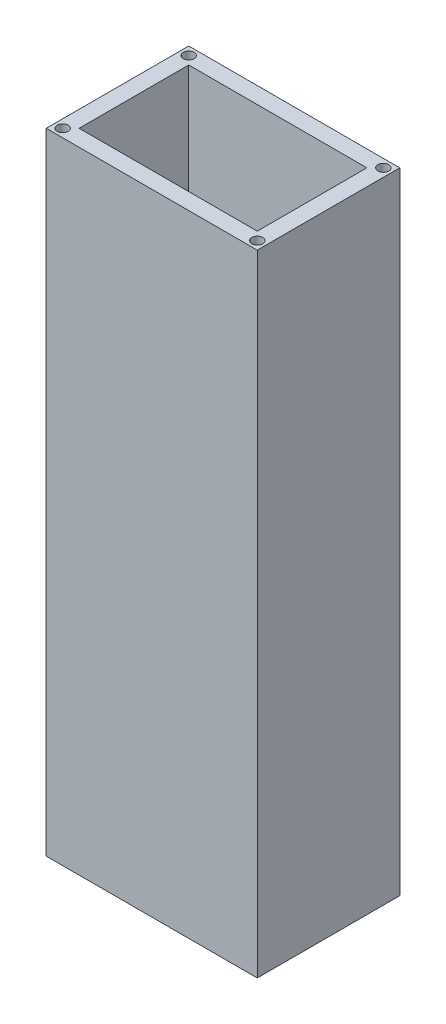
ISO-10303-21;
HEADER;
FILE_DESCRIPTION(('STEP AP214'),'2;1');
FILE_NAME('part.step','',(''),(''),'','','');
FILE_SCHEMA(('AUTOMOTIVE_DESIGN { 1 0 10303 214 1 1 1 1 }'));
ENDSEC;
DATA;
#1=APPLICATION_CONTEXT('core data for automotive mechanical design processes');
#2=APPLICATION_PROTOCOL_DEFINITION('international standard','automotive_design',2000,#1);
#3=PRODUCT_CONTEXT('',#1,'mechanical');
#4=PRODUCT('Part','Part','',(#3));
#5=PRODUCT_RELATED_PRODUCT_CATEGORY('part','',(#4));
#6=PRODUCT_DEFINITION_FORMATION('','',#4);
#7=PRODUCT_DEFINITION_CONTEXT('part definition',#1,'design');
#8=PRODUCT_DEFINITION('design','',#6,#7);
#9=PRODUCT_DEFINITION_SHAPE('','',#8);
#10=(LENGTH_UNIT() NAMED_UNIT(*) SI_UNIT(.MILLI.,.METRE.));
#11=(NAMED_UNIT(*) PLANE_ANGLE_UNIT() SI_UNIT($,.RADIAN.));
#12=(NAMED_UNIT(*) SI_UNIT($,.STERADIAN.) SOLID_ANGLE_UNIT());
#13=UNCERTAINTY_MEASURE_WITH_UNIT(LENGTH_MEASURE(1.E-05),#10,'distance_accuracy_value','');
#14=(GEOMETRIC_REPRESENTATION_CONTEXT(3) GLOBAL_UNCERTAINTY_ASSIGNED_CONTEXT((#13)) GLOBAL_UNIT_ASSIGNED_CONTEXT((#10,
#11,#12)) REPRESENTATION_CONTEXT('',''));
#15=CARTESIAN_POINT('',(0.,0.,0.));
#16=DIRECTION('',(0.,0.,1.));
#17=DIRECTION('',(1.,0.,0.));
#18=AXIS2_PLACEMENT_3D('',#15,#16,#17);
#19=CARTESIAN_POINT('',(0.,230.,0.));
#20=DIRECTION('',(0.,-1.,0.));
#21=DIRECTION('',(0.,0.,-1.));
#22=AXIS2_PLACEMENT_3D('',#19,#20,#21);
#23=PLANE('',#22);
#24=DIRECTION('',(0.,0.,1.));
#25=VECTOR('',#24,1.);
#26=CARTESIAN_POINT('',(-38.5,230.,26.));
#27=LINE('',#26,#25);
#28=CARTESIAN_POINT('',(-38.5,230.,-26.));
#29=VERTEX_POINT('',#28);
#30=CARTESIAN_POINT('',(-38.5,230.,26.));
#31=VERTEX_POINT('',#30);
#32=EDGE_CURVE('E246',#29,#31,#27,.T.);
#33=ORIENTED_EDGE('',*,*,#32,.T.);
#34=DIRECTION('',(1.,0.,0.));
#35=VECTOR('',#34,1.);
#36=CARTESIAN_POINT('',(-38.5,230.,26.));
#37=LINE('',#36,#35);
#38=CARTESIAN_POINT('',(38.5,230.,26.));
#39=VERTEX_POINT('',#38);
#40=EDGE_CURVE('E250',#31,#39,#37,.T.);
#41=ORIENTED_EDGE('',*,*,#40,.T.);
#42=DIRECTION('',(0.,0.,-1.));
#43=VECTOR('',#42,1.);
#44=CARTESIAN_POINT('',(38.5,230.,26.));
#45=LINE('',#44,#43);
#46=CARTESIAN_POINT('',(38.5,230.,-26.));
#47=VERTEX_POINT('',#46);
#48=EDGE_CURVE('E254',#39,#47,#45,.T.);
#49=ORIENTED_EDGE('',*,*,#48,.T.);
#50=DIRECTION('',(-1.,0.,0.));
#51=VECTOR('',#50,1.);
#52=CARTESIAN_POINT('',(-38.5,230.,-26.));
#53=LINE('',#52,#51);
#54=EDGE_CURVE('E257',#47,#29,#53,.T.);
#55=ORIENTED_EDGE('',*,*,#54,.T.);
#56=EDGE_LOOP('',(#33,#41,#49,#55));
#57=FACE_BOUND('',#56,.T.);
#58=DIRECTION('',(0.,0.,-1.));
#59=VECTOR('',#58,1.);
#60=CARTESIAN_POINT('',(32.5,230.,20.));
#61=LINE('',#60,#59);
#62=CARTESIAN_POINT('',(32.5,230.,20.));
#63=VERTEX_POINT('',#62);
#64=CARTESIAN_POINT('',(32.5,230.,-20.));
#65=VERTEX_POINT('',#64);
#66=EDGE_CURVE('E203',#63,#65,#61,.T.);
#67=ORIENTED_EDGE('',*,*,#66,.F.);
#68=DIRECTION('',(1.,0.,0.));
#69=VECTOR('',#68,1.);
#70=CARTESIAN_POINT('',(-32.5,230.,20.));
#71=LINE('',#70,#69);
#72=CARTESIAN_POINT('',(-32.5,230.,20.));
#73=VERTEX_POINT('',#72);
#74=EDGE_CURVE('E214',#73,#63,#71,.T.);
#75=ORIENTED_EDGE('',*,*,#74,.F.);
#76=DIRECTION('',(0.,0.,1.));
#77=VECTOR('',#76,1.);
#78=CARTESIAN_POINT('',(-32.5,230.,20.));
#79=LINE('',#78,#77);
#80=CARTESIAN_POINT('',(-32.5,230.,-20.));
#81=VERTEX_POINT('',#80);
#82=EDGE_CURVE('E210',#81,#73,#79,.T.);
#83=ORIENTED_EDGE('',*,*,#82,.F.);
#84=DIRECTION('',(-1.,0.,0.));
#85=VECTOR('',#84,1.);
#86=CARTESIAN_POINT('',(-32.5,230.,-20.));
#87=LINE('',#86,#85);
#88=EDGE_CURVE('E206',#65,#81,#87,.T.);
#89=ORIENTED_EDGE('',*,*,#88,.F.);
#90=EDGE_LOOP('',(#67,#75,#83,#89));
#91=FACE_BOUND('',#90,.T.);
#92=CARTESIAN_POINT('',(35.5,230.,-23.));
#93=DIRECTION('',(0.,1.,0.));
#94=DIRECTION('',(0.,0.,1.));
#95=AXIS2_PLACEMENT_3D('',#92,#93,#94);
#96=CIRCLE('',#95,2.);
#97=CARTESIAN_POINT('',(35.5,230.,-21.));
#98=VERTEX_POINT('',#97);
#99=EDGE_CURVE('E195',#98,#98,#96,.T.);
#100=ORIENTED_EDGE('',*,*,#99,.F.);
#101=EDGE_LOOP('',(#100));
#102=FACE_BOUND('',#101,.T.);
#103=CARTESIAN_POINT('',(35.5,230.,23.));
#104=DIRECTION('',(0.,1.,0.));
#105=DIRECTION('',(0.,0.,-1.));
#106=AXIS2_PLACEMENT_3D('',#103,#104,#105);
#107=CIRCLE('',#106,2.);
#108=CARTESIAN_POINT('',(35.5,230.,21.));
#109=VERTEX_POINT('',#108);
#110=EDGE_CURVE('E187',#109,#109,#107,.T.);
#111=ORIENTED_EDGE('',*,*,#110,.F.);
#112=EDGE_LOOP('',(#111));
#113=FACE_BOUND('',#112,.T.);
#114=CARTESIAN_POINT('',(-35.5,230.,23.));
#115=DIRECTION('',(0.,1.,0.));
#116=DIRECTION('',(0.,0.,1.));
#117=AXIS2_PLACEMENT_3D('',#114,#115,#116);
#118=CIRCLE('',#117,2.);
#119=CARTESIAN_POINT('',(-35.5,230.,25.));
#120=VERTEX_POINT('',#119);
#121=EDGE_CURVE('E179',#120,#120,#118,.T.);
#122=ORIENTED_EDGE('',*,*,#121,.F.);
#123=EDGE_LOOP('',(#122));
#124=FACE_BOUND('',#123,.T.);
#125=CARTESIAN_POINT('',(-35.5,230.,-23.));
#126=DIRECTION('',(0.,1.,0.));
#127=DIRECTION('',(0.,0.,-1.));
#128=AXIS2_PLACEMENT_3D('',#125,#126,#127);
#129=CIRCLE('',#128,2.);
#130=CARTESIAN_POINT('',(-35.5,230.,-25.));
#131=VERTEX_POINT('',#130);
#132=EDGE_CURVE('E171',#131,#131,#129,.T.);
#133=ORIENTED_EDGE('',*,*,#132,.F.);
#134=EDGE_LOOP('',(#133));
#135=FACE_BOUND('',#134,.T.);
#136=ADVANCED_FACE('F45',(#57,#91,#102,#113,#124,#135),#23,.F.);
#137=CARTESIAN_POINT('',(0.,0.,0.));
#138=DIRECTION('',(0.,-1.,0.));
#139=DIRECTION('',(0.,0.,-1.));
#140=AXIS2_PLACEMENT_3D('',#137,#138,#139);
#141=PLANE('',#140);
#142=CARTESIAN_POINT('',(-35.5,0.,23.));
#143=DIRECTION('',(0.,1.,0.));
#144=DIRECTION('',(0.,0.,1.));
#145=AXIS2_PLACEMENT_3D('',#142,#143,#144);
#146=CIRCLE('',#145,2.);
#147=CARTESIAN_POINT('',(-35.5,0.,25.));
#148=VERTEX_POINT('',#147);
#149=EDGE_CURVE('E175',#148,#148,#146,.T.);
#150=ORIENTED_EDGE('',*,*,#149,.T.);
#151=EDGE_LOOP('',(#150));
#152=FACE_BOUND('',#151,.T.);
#153=CARTESIAN_POINT('',(35.5,0.,-23.));
#154=DIRECTION('',(0.,1.,0.));
#155=DIRECTION('',(0.,0.,1.));
#156=AXIS2_PLACEMENT_3D('',#153,#154,#155);
#157=CIRCLE('',#156,2.);
#158=CARTESIAN_POINT('',(35.5,0.,-21.));
#159=VERTEX_POINT('',#158);
#160=EDGE_CURVE('E191',#159,#159,#157,.T.);
#161=ORIENTED_EDGE('',*,*,#160,.T.);
#162=EDGE_LOOP('',(#161));
#163=FACE_BOUND('',#162,.T.);
#164=DIRECTION('',(0.,0.,1.));
#165=VECTOR('',#164,1.);
#166=CARTESIAN_POINT('',(-38.5,0.,26.));
#167=LINE('',#166,#165);
#168=CARTESIAN_POINT('',(-38.5,0.,-26.));
#169=VERTEX_POINT('',#168);
#170=CARTESIAN_POINT('',(-38.5,0.,26.));
#171=VERTEX_POINT('',#170);
#172=EDGE_CURVE('E245',#169,#171,#167,.T.);
#173=ORIENTED_EDGE('',*,*,#172,.F.);
#174=DIRECTION('',(-1.,0.,0.));
#175=VECTOR('',#174,1.);
#176=CARTESIAN_POINT('',(-38.5,0.,-26.));
#177=LINE('',#176,#175);
#178=CARTESIAN_POINT('',(38.5,0.,-26.));
#179=VERTEX_POINT('',#178);
#180=EDGE_CURVE('E251',#179,#169,#177,.T.);
#181=ORIENTED_EDGE('',*,*,#180,.F.);
#182=DIRECTION('',(0.,0.,-1.));
#183=VECTOR('',#182,1.);
#184=CARTESIAN_POINT('',(38.5,0.,26.));
#185=LINE('',#184,#183);
#186=CARTESIAN_POINT('',(38.5,0.,26.));
#187=VERTEX_POINT('',#186);
#188=EDGE_CURVE('E267',#187,#179,#185,.T.);
#189=ORIENTED_EDGE('',*,*,#188,.F.);
#190=DIRECTION('',(1.,0.,0.));
#191=VECTOR('',#190,1.);
#192=CARTESIAN_POINT('',(-38.5,0.,26.));
#193=LINE('',#192,#191);
#194=EDGE_CURVE('E264',#171,#187,#193,.T.);
#195=ORIENTED_EDGE('',*,*,#194,.F.);
#196=EDGE_LOOP('',(#173,#181,#189,#195));
#197=FACE_BOUND('',#196,.T.);
#198=DIRECTION('',(1.,0.,0.));
#199=VECTOR('',#198,1.);
#200=CARTESIAN_POINT('',(-32.5,0.,20.));
#201=LINE('',#200,#199);
#202=CARTESIAN_POINT('',(-32.5,0.,20.));
#203=VERTEX_POINT('',#202);
#204=CARTESIAN_POINT('',(32.5,0.,20.));
#205=VERTEX_POINT('',#204);
#206=EDGE_CURVE('E207',#203,#205,#201,.T.);
#207=ORIENTED_EDGE('',*,*,#206,.T.);
#208=DIRECTION('',(0.,0.,-1.));
#209=VECTOR('',#208,1.);
#210=CARTESIAN_POINT('',(32.5,0.,20.));
#211=LINE('',#210,#209);
#212=CARTESIAN_POINT('',(32.5,0.,-20.));
#213=VERTEX_POINT('',#212);
#214=EDGE_CURVE('E199',#205,#213,#211,.T.);
#215=ORIENTED_EDGE('',*,*,#214,.T.);
#216=DIRECTION('',(-1.,0.,0.));
#217=VECTOR('',#216,1.);
#218=CARTESIAN_POINT('',(-32.5,0.,-20.));
#219=LINE('',#218,#217);
#220=CARTESIAN_POINT('',(-32.5,0.,-20.));
#221=VERTEX_POINT('',#220);
#222=EDGE_CURVE('E221',#213,#221,#219,.T.);
#223=ORIENTED_EDGE('',*,*,#222,.T.);
#224=DIRECTION('',(0.,0.,1.));
#225=VECTOR('',#224,1.);
#226=CARTESIAN_POINT('',(-32.5,0.,20.));
#227=LINE('',#226,#225);
#228=EDGE_CURVE('E225',#221,#203,#227,.T.);
#229=ORIENTED_EDGE('',*,*,#228,.T.);
#230=EDGE_LOOP('',(#207,#215,#223,#229));
#231=FACE_BOUND('',#230,.T.);
#232=CARTESIAN_POINT('',(35.5,0.,23.));
#233=DIRECTION('',(0.,1.,0.));
#234=DIRECTION('',(0.,0.,-1.));
#235=AXIS2_PLACEMENT_3D('',#232,#233,#234);
#236=CIRCLE('',#235,2.);
#237=CARTESIAN_POINT('',(35.5,0.,21.));
#238=VERTEX_POINT('',#237);
#239=EDGE_CURVE('E183',#238,#238,#236,.T.);
#240=ORIENTED_EDGE('',*,*,#239,.T.);
#241=EDGE_LOOP('',(#240));
#242=FACE_BOUND('',#241,.T.);
#243=CARTESIAN_POINT('',(-35.5,0.,-23.));
#244=DIRECTION('',(0.,1.,0.));
#245=DIRECTION('',(0.,0.,-1.));
#246=AXIS2_PLACEMENT_3D('',#243,#244,#245);
#247=CIRCLE('',#246,2.);
#248=CARTESIAN_POINT('',(-35.5,0.,-25.));
#249=VERTEX_POINT('',#248);
#250=EDGE_CURVE('E164',#249,#249,#247,.T.);
#251=ORIENTED_EDGE('',*,*,#250,.T.);
#252=EDGE_LOOP('',(#251));
#253=FACE_BOUND('',#252,.T.);
#254=ADVANCED_FACE('F310',(#152,#163,#197,#231,#242,#253),#141,.T.);
#255=CARTESIAN_POINT('',(-38.5,230.,26.));
#256=DIRECTION('',(1.,0.,0.));
#257=DIRECTION('',(0.,0.,-1.));
#258=AXIS2_PLACEMENT_3D('',#255,#256,#257);
#259=PLANE('',#258);
#260=ORIENTED_EDGE('',*,*,#172,.T.);
#261=DIRECTION('',(0.,-1.,0.));
#262=VECTOR('',#261,1.);
#263=CARTESIAN_POINT('',(-38.5,230.,26.));
#264=LINE('',#263,#262);
#265=EDGE_CURVE('E283',#31,#171,#264,.T.);
#266=ORIENTED_EDGE('',*,*,#265,.F.);
#267=ORIENTED_EDGE('',*,*,#32,.F.);
#268=DIRECTION('',(0.,-1.,0.));
#269=VECTOR('',#268,1.);
#270=CARTESIAN_POINT('',(-38.5,230.,-26.));
#271=LINE('',#270,#269);
#272=EDGE_CURVE('E260',#29,#169,#271,.T.);
#273=ORIENTED_EDGE('',*,*,#272,.T.);
#274=EDGE_LOOP('',(#260,#266,#267,#273));
#275=FACE_BOUND('',#274,.T.);
#276=ADVANCED_FACE('F47',(#275),#259,.F.);
#277=CARTESIAN_POINT('',(-38.5,230.,26.));
#278=DIRECTION('',(0.,0.,-1.));
#279=DIRECTION('',(-1.,0.,0.));
#280=AXIS2_PLACEMENT_3D('',#277,#278,#279);
#281=PLANE('',#280);
#282=ORIENTED_EDGE('',*,*,#194,.T.);
#283=DIRECTION('',(0.,-1.,0.));
#284=VECTOR('',#283,1.);
#285=CARTESIAN_POINT('',(38.5,230.,26.));
#286=LINE('',#285,#284);
#287=EDGE_CURVE('E279',#39,#187,#286,.T.);
#288=ORIENTED_EDGE('',*,*,#287,.F.);
#289=ORIENTED_EDGE('',*,*,#40,.F.);
#290=ORIENTED_EDGE('',*,*,#265,.T.);
#291=EDGE_LOOP('',(#282,#288,#289,#290));
#292=FACE_BOUND('',#291,.T.);
#293=ADVANCED_FACE('F327',(#292),#281,.F.);
#294=CARTESIAN_POINT('',(38.5,230.,26.));
#295=DIRECTION('',(-1.,0.,0.));
#296=DIRECTION('',(0.,0.,1.));
#297=AXIS2_PLACEMENT_3D('',#294,#295,#296);
#298=PLANE('',#297);
#299=ORIENTED_EDGE('',*,*,#188,.T.);
#300=DIRECTION('',(0.,-1.,0.));
#301=VECTOR('',#300,1.);
#302=CARTESIAN_POINT('',(38.5,230.,-26.));
#303=LINE('',#302,#301);
#304=EDGE_CURVE('E275',#47,#179,#303,.T.);
#305=ORIENTED_EDGE('',*,*,#304,.F.);
#306=ORIENTED_EDGE('',*,*,#48,.F.);
#307=ORIENTED_EDGE('',*,*,#287,.T.);
#308=EDGE_LOOP('',(#299,#305,#306,#307));
#309=FACE_BOUND('',#308,.T.);
#310=ADVANCED_FACE('F325',(#309),#298,.F.);
#311=CARTESIAN_POINT('',(-38.5,230.,-26.));
#312=DIRECTION('',(0.,0.,1.));
#313=DIRECTION('',(1.,0.,0.));
#314=AXIS2_PLACEMENT_3D('',#311,#312,#313);
#315=PLANE('',#314);
#316=DIRECTION('',(1.,0.,0.));
#317=VECTOR('',#316,1.);
#318=CARTESIAN_POINT('',(-15.,55.,-26.));
#319=LINE('',#318,#317);
#320=CARTESIAN_POINT('',(-15.,55.,-26.));
#321=VERTEX_POINT('',#320);
#322=CARTESIAN_POINT('',(15.,55.,-26.));
#323=VERTEX_POINT('',#322);
#324=EDGE_CURVE('E143',#321,#323,#319,.T.);
#325=ORIENTED_EDGE('',*,*,#324,.T.);
#326=DIRECTION('',(0.,1.,0.));
#327=VECTOR('',#326,1.);
#328=CARTESIAN_POINT('',(15.,55.,-26.));
#329=LINE('',#328,#327);
#330=CARTESIAN_POINT('',(15.,85.,-26.));
#331=VERTEX_POINT('',#330);
#332=EDGE_CURVE('E137',#323,#331,#329,.T.);
#333=ORIENTED_EDGE('',*,*,#332,.T.);
#334=DIRECTION('',(-1.,0.,0.));
#335=VECTOR('',#334,1.);
#336=CARTESIAN_POINT('',(-15.,85.,-26.));
#337=LINE('',#336,#335);
#338=CARTESIAN_POINT('',(-15.,85.,-26.));
#339=VERTEX_POINT('',#338);
#340=EDGE_CURVE('E146',#331,#339,#337,.T.);
#341=ORIENTED_EDGE('',*,*,#340,.T.);
#342=DIRECTION('',(0.,-1.,0.));
#343=VECTOR('',#342,1.);
#344=CARTESIAN_POINT('',(-15.,55.,-26.));
#345=LINE('',#344,#343);
#346=EDGE_CURVE('E61',#339,#321,#345,.T.);
#347=ORIENTED_EDGE('',*,*,#346,.T.);
#348=EDGE_LOOP('',(#325,#333,#341,#347));
#349=FACE_BOUND('',#348,.T.);
#350=ORIENTED_EDGE('',*,*,#180,.T.);
#351=ORIENTED_EDGE('',*,*,#272,.F.);
#352=ORIENTED_EDGE('',*,*,#54,.F.);
#353=ORIENTED_EDGE('',*,*,#304,.T.);
#354=EDGE_LOOP('',(#350,#351,#352,#353));
#355=FACE_BOUND('',#354,.T.);
#356=ADVANCED_FACE('F151',(#349,#355),#315,.F.);
#357=CARTESIAN_POINT('',(32.5,230.,20.));
#358=DIRECTION('',(-1.,0.,0.));
#359=DIRECTION('',(0.,0.,1.));
#360=AXIS2_PLACEMENT_3D('',#357,#358,#359);
#361=PLANE('',#360);
#362=ORIENTED_EDGE('',*,*,#214,.F.);
#363=DIRECTION('',(0.,-1.,0.));
#364=VECTOR('',#363,1.);
#365=CARTESIAN_POINT('',(32.5,230.,20.));
#366=LINE('',#365,#364);
#367=EDGE_CURVE('E217',#63,#205,#366,.T.);
#368=ORIENTED_EDGE('',*,*,#367,.F.);
#369=ORIENTED_EDGE('',*,*,#66,.T.);
#370=DIRECTION('',(0.,-1.,0.));
#371=VECTOR('',#370,1.);
#372=CARTESIAN_POINT('',(32.5,230.,-20.));
#373=LINE('',#372,#371);
#374=EDGE_CURVE('E241',#65,#213,#373,.T.);
#375=ORIENTED_EDGE('',*,*,#374,.T.);
#376=EDGE_LOOP('',(#362,#368,#369,#375));
#377=FACE_BOUND('',#376,.T.);
#378=ADVANCED_FACE('F320',(#377),#361,.T.);
#379=CARTESIAN_POINT('',(-32.5,230.,-20.));
#380=DIRECTION('',(0.,0.,1.));
#381=DIRECTION('',(1.,0.,0.));
#382=AXIS2_PLACEMENT_3D('',#379,#380,#381);
#383=PLANE('',#382);
#384=DIRECTION('',(0.,1.,0.));
#385=VECTOR('',#384,1.);
#386=CARTESIAN_POINT('',(15.,230.,-20.));
#387=LINE('',#386,#385);
#388=CARTESIAN_POINT('',(15.,55.,-20.));
#389=VERTEX_POINT('',#388);
#390=CARTESIAN_POINT('',(15.,85.,-20.));
#391=VERTEX_POINT('',#390);
#392=EDGE_CURVE('E11',#389,#391,#387,.T.);
#393=ORIENTED_EDGE('',*,*,#392,.F.);
#394=DIRECTION('',(1.,0.,0.));
#395=VECTOR('',#394,1.);
#396=CARTESIAN_POINT('',(-32.5,55.,-20.));
#397=LINE('',#396,#395);
#398=CARTESIAN_POINT('',(-15.,55.,-20.));
#399=VERTEX_POINT('',#398);
#400=EDGE_CURVE('E54',#399,#389,#397,.T.);
#401=ORIENTED_EDGE('',*,*,#400,.F.);
#402=DIRECTION('',(0.,-1.,0.));
#403=VECTOR('',#402,1.);
#404=CARTESIAN_POINT('',(-15.,230.,-20.));
#405=LINE('',#404,#403);
#406=CARTESIAN_POINT('',(-15.,85.,-20.));
#407=VERTEX_POINT('',#406);
#408=EDGE_CURVE('E290',#407,#399,#405,.T.);
#409=ORIENTED_EDGE('',*,*,#408,.F.);
#410=DIRECTION('',(-1.,0.,0.));
#411=VECTOR('',#410,1.);
#412=CARTESIAN_POINT('',(-32.5,85.,-20.));
#413=LINE('',#412,#411);
#414=EDGE_CURVE('E287',#391,#407,#413,.T.);
#415=ORIENTED_EDGE('',*,*,#414,.F.);
#416=EDGE_LOOP('',(#393,#401,#409,#415));
#417=FACE_BOUND('',#416,.T.);
#418=ORIENTED_EDGE('',*,*,#222,.F.);
#419=ORIENTED_EDGE('',*,*,#374,.F.);
#420=ORIENTED_EDGE('',*,*,#88,.T.);
#421=DIRECTION('',(0.,-1.,0.));
#422=VECTOR('',#421,1.);
#423=CARTESIAN_POINT('',(-32.5,230.,-20.));
#424=LINE('',#423,#422);
#425=EDGE_CURVE('E238',#81,#221,#424,.T.);
#426=ORIENTED_EDGE('',*,*,#425,.T.);
#427=EDGE_LOOP('',(#418,#419,#420,#426));
#428=FACE_BOUND('',#427,.T.);
#429=ADVANCED_FACE('F298',(#417,#428),#383,.T.);
#430=CARTESIAN_POINT('',(-32.5,230.,20.));
#431=DIRECTION('',(1.,0.,0.));
#432=DIRECTION('',(0.,0.,-1.));
#433=AXIS2_PLACEMENT_3D('',#430,#431,#432);
#434=PLANE('',#433);
#435=ORIENTED_EDGE('',*,*,#228,.F.);
#436=ORIENTED_EDGE('',*,*,#425,.F.);
#437=ORIENTED_EDGE('',*,*,#82,.T.);
#438=DIRECTION('',(0.,-1.,0.));
#439=VECTOR('',#438,1.);
#440=CARTESIAN_POINT('',(-32.5,230.,20.));
#441=LINE('',#440,#439);
#442=EDGE_CURVE('E235',#73,#203,#441,.T.);
#443=ORIENTED_EDGE('',*,*,#442,.T.);
#444=EDGE_LOOP('',(#435,#436,#437,#443));
#445=FACE_BOUND('',#444,.T.);
#446=ADVANCED_FACE('F377',(#445),#434,.T.);
#447=CARTESIAN_POINT('',(-32.5,230.,20.));
#448=DIRECTION('',(0.,0.,-1.));
#449=DIRECTION('',(-1.,0.,0.));
#450=AXIS2_PLACEMENT_3D('',#447,#448,#449);
#451=PLANE('',#450);
#452=ORIENTED_EDGE('',*,*,#206,.F.);
#453=ORIENTED_EDGE('',*,*,#442,.F.);
#454=ORIENTED_EDGE('',*,*,#74,.T.);
#455=ORIENTED_EDGE('',*,*,#367,.T.);
#456=EDGE_LOOP('',(#452,#453,#454,#455));
#457=FACE_BOUND('',#456,.T.);
#458=ADVANCED_FACE('F373',(#457),#451,.T.);
#459=CARTESIAN_POINT('',(35.5,230.,-23.));
#460=DIRECTION('',(0.,-1.,0.));
#461=DIRECTION('',(0.,0.,-1.));
#462=AXIS2_PLACEMENT_3D('',#459,#460,#461);
#463=CYLINDRICAL_SURFACE('',#462,2.);
#464=ORIENTED_EDGE('',*,*,#99,.T.);
#465=EDGE_LOOP('',(#464));
#466=FACE_BOUND('',#465,.T.);
#467=ORIENTED_EDGE('',*,*,#160,.F.);
#468=EDGE_LOOP('',(#467));
#469=FACE_BOUND('',#468,.T.);
#470=ADVANCED_FACE('F369',(#466,#469),#463,.F.);
#471=CARTESIAN_POINT('',(35.5,230.,23.));
#472=DIRECTION('',(0.,-1.,0.));
#473=DIRECTION('',(0.,0.,-1.));
#474=AXIS2_PLACEMENT_3D('',#471,#472,#473);
#475=CYLINDRICAL_SURFACE('',#474,2.);
#476=ORIENTED_EDGE('',*,*,#110,.T.);
#477=EDGE_LOOP('',(#476));
#478=FACE_BOUND('',#477,.T.);
#479=ORIENTED_EDGE('',*,*,#239,.F.);
#480=EDGE_LOOP('',(#479));
#481=FACE_BOUND('',#480,.T.);
#482=ADVANCED_FACE('F363',(#478,#481),#475,.F.);
#483=CARTESIAN_POINT('',(-35.5,230.,23.));
#484=DIRECTION('',(0.,-1.,0.));
#485=DIRECTION('',(0.,0.,-1.));
#486=AXIS2_PLACEMENT_3D('',#483,#484,#485);
#487=CYLINDRICAL_SURFACE('',#486,2.);
#488=ORIENTED_EDGE('',*,*,#121,.T.);
#489=EDGE_LOOP('',(#488));
#490=FACE_BOUND('',#489,.T.);
#491=ORIENTED_EDGE('',*,*,#149,.F.);
#492=EDGE_LOOP('',(#491));
#493=FACE_BOUND('',#492,.T.);
#494=ADVANCED_FACE('F355',(#490,#493),#487,.F.);
#495=CARTESIAN_POINT('',(-35.5,230.,-23.));
#496=DIRECTION('',(0.,-1.,0.));
#497=DIRECTION('',(0.,0.,-1.));
#498=AXIS2_PLACEMENT_3D('',#495,#496,#497);
#499=CYLINDRICAL_SURFACE('',#498,2.);
#500=ORIENTED_EDGE('',*,*,#132,.T.);
#501=EDGE_LOOP('',(#500));
#502=FACE_BOUND('',#501,.T.);
#503=ORIENTED_EDGE('',*,*,#250,.F.);
#504=EDGE_LOOP('',(#503));
#505=FACE_BOUND('',#504,.T.);
#506=ADVANCED_FACE('F353',(#502,#505),#499,.F.);
#507=CARTESIAN_POINT('',(15.,55.,-26.));
#508=DIRECTION('',(1.,0.,0.));
#509=DIRECTION('',(0.,0.,-1.));
#510=AXIS2_PLACEMENT_3D('',#507,#508,#509);
#511=PLANE('',#510);
#512=ORIENTED_EDGE('',*,*,#392,.T.);
#513=DIRECTION('',(0.,0.,1.));
#514=VECTOR('',#513,1.);
#515=CARTESIAN_POINT('',(15.,85.,-26.));
#516=LINE('',#515,#514);
#517=EDGE_CURVE('E69',#331,#391,#516,.T.);
#518=ORIENTED_EDGE('',*,*,#517,.F.);
#519=ORIENTED_EDGE('',*,*,#332,.F.);
#520=DIRECTION('',(0.,0.,1.));
#521=VECTOR('',#520,1.);
#522=CARTESIAN_POINT('',(15.,55.,-26.));
#523=LINE('',#522,#521);
#524=EDGE_CURVE('E161',#323,#389,#523,.T.);
#525=ORIENTED_EDGE('',*,*,#524,.T.);
#526=EDGE_LOOP('',(#512,#518,#519,#525));
#527=FACE_BOUND('',#526,.T.);
#528=ADVANCED_FACE('F134',(#527),#511,.F.);
#529=CARTESIAN_POINT('',(-15.,55.,-26.));
#530=DIRECTION('',(0.,-1.,0.));
#531=DIRECTION('',(0.,0.,-1.));
#532=AXIS2_PLACEMENT_3D('',#529,#530,#531);
#533=PLANE('',#532);
#534=ORIENTED_EDGE('',*,*,#400,.T.);
#535=ORIENTED_EDGE('',*,*,#524,.F.);
#536=ORIENTED_EDGE('',*,*,#324,.F.);
#537=DIRECTION('',(0.,0.,1.));
#538=VECTOR('',#537,1.);
#539=CARTESIAN_POINT('',(-15.,55.,-26.));
#540=LINE('',#539,#538);
#541=EDGE_CURVE('E165',#321,#399,#540,.T.);
#542=ORIENTED_EDGE('',*,*,#541,.T.);
#543=EDGE_LOOP('',(#534,#535,#536,#542));
#544=FACE_BOUND('',#543,.T.);
#545=ADVANCED_FACE('F295',(#544),#533,.F.);
#546=CARTESIAN_POINT('',(-15.,55.,-26.));
#547=DIRECTION('',(-1.,0.,0.));
#548=DIRECTION('',(0.,0.,1.));
#549=AXIS2_PLACEMENT_3D('',#546,#547,#548);
#550=PLANE('',#549);
#551=ORIENTED_EDGE('',*,*,#408,.T.);
#552=ORIENTED_EDGE('',*,*,#541,.F.);
#553=ORIENTED_EDGE('',*,*,#346,.F.);
#554=DIRECTION('',(0.,0.,1.));
#555=VECTOR('',#554,1.);
#556=CARTESIAN_POINT('',(-15.,85.,-26.));
#557=LINE('',#556,#555);
#558=EDGE_CURVE('E142',#339,#407,#557,.T.);
#559=ORIENTED_EDGE('',*,*,#558,.T.);
#560=EDGE_LOOP('',(#551,#552,#553,#559));
#561=FACE_BOUND('',#560,.T.);
#562=ADVANCED_FACE('F300',(#561),#550,.F.);
#563=CARTESIAN_POINT('',(-15.,85.,-26.));
#564=DIRECTION('',(0.,1.,0.));
#565=DIRECTION('',(0.,0.,1.));
#566=AXIS2_PLACEMENT_3D('',#563,#564,#565);
#567=PLANE('',#566);
#568=ORIENTED_EDGE('',*,*,#414,.T.);
#569=ORIENTED_EDGE('',*,*,#558,.F.);
#570=ORIENTED_EDGE('',*,*,#340,.F.);
#571=ORIENTED_EDGE('',*,*,#517,.T.);
#572=EDGE_LOOP('',(#568,#569,#570,#571));
#573=FACE_BOUND('',#572,.T.);
#574=ADVANCED_FACE('F147',(#573),#567,.F.);
#575=CLOSED_SHELL('',(#136,#254,#276,#293,#310,#356,#378,#429,#446,#458,#470,#482,#494,#506,
#528,#545,#562,#574));
#576=MANIFOLD_SOLID_BREP('B2',#575);
#577=ADVANCED_BREP_SHAPE_REPRESENTATION('',(#18,#576),#14);
#578=SHAPE_DEFINITION_REPRESENTATION(#9,#577);
ENDSEC;
END-ISO-10303-21;
